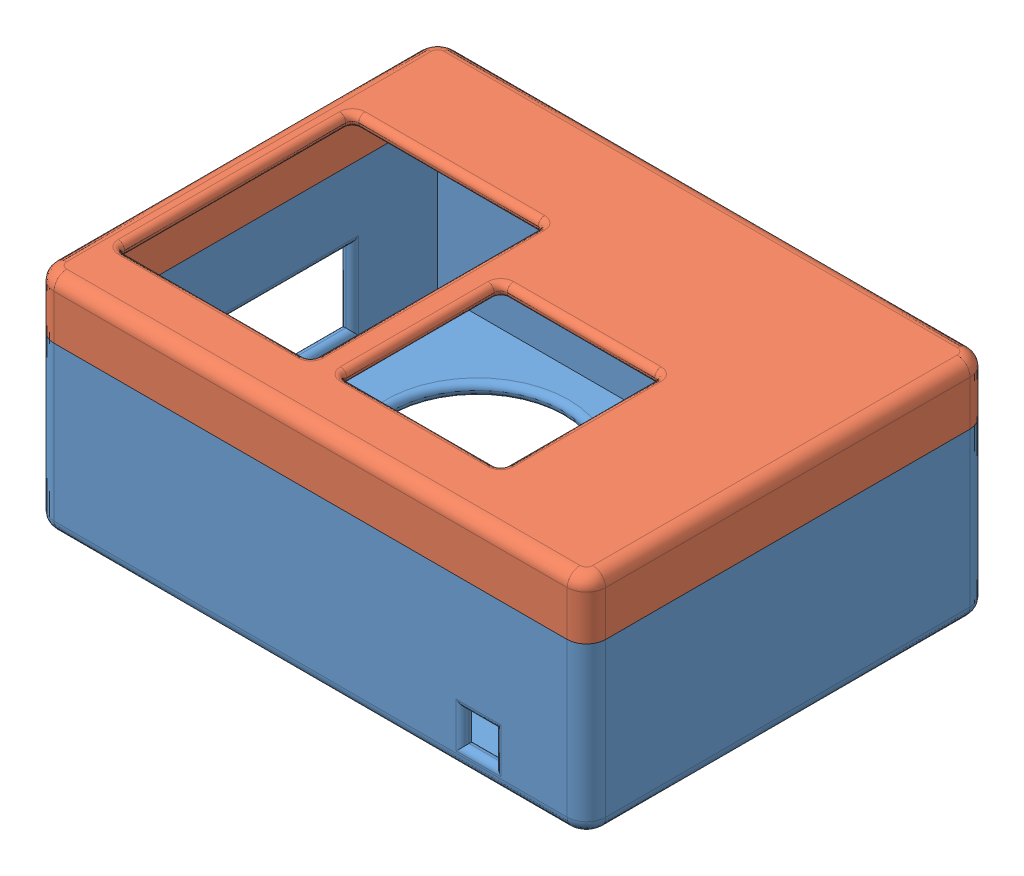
SolidWorks assembly Assem1.sldasm, configuration Default (file format 14000). Lengths in mm.
Overall size (86 35 62.8).
2 component instances, 2 part files, 4 mates.
Components (placement in the parent):
- Bottom Part-1: Bottom Part.SLDPRT [Default] at (40.5799 23.3335 71.8425) size (86 26 62.8)
- Top Part-1: Top Part.SLDPRT [Default] at (32.8115 49.3335 71.4432) x (1 0 0.000016) z (-0.000016 0 1) size (86 9 62.8)
Mates (geometry in assembly coordinates):
- Coincident1: coincident anti-aligned: plane of Bottom Part-1 through (40.5799 49.3335 71.8425) normal (0 1 0); plane of Top Part-1 through (32.8115 49.3335 71.4432) normal (0 -1 0)
- Coincident2: coincident: circle of Bottom Part-1; moEndPointRef_w of Top Part-1
- Coincident3: coincident: unknown of Bottom Part-1; unknown of Top Part-1
- Coincident4: coincident: unknown of Bottom Part-1; unknown of Top Part-1
